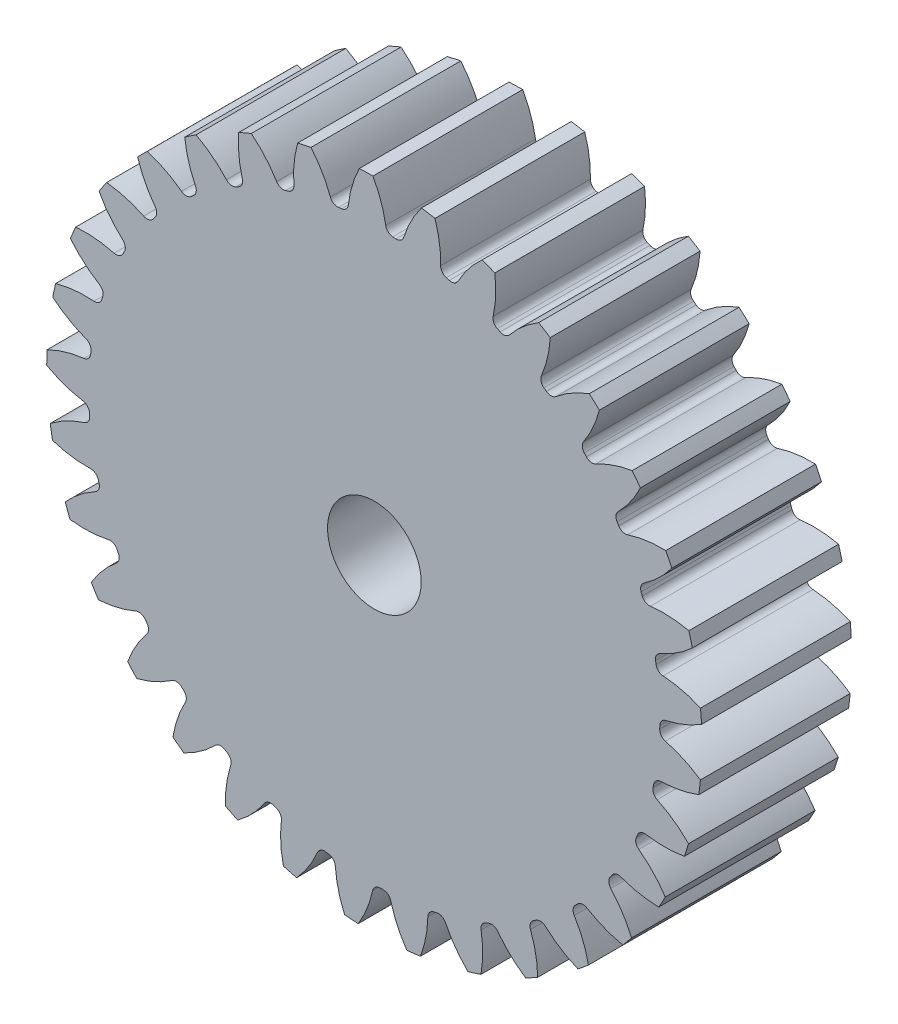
from build123d import *

# Parameters (mm, degrees)
SKETCH3_R         = 222.25
GEARBODY_DEPTH    = 101.6
TOOTHCUT_DEPTH    = 331.322092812
CIRPATTERN1_COUNT = 33
BOREDIA_R         = 31.75
BORE_DEPTH        = 12700


with BuildPart() as part:
    # Sketch3 → gearBody (new body)
    with BuildSketch(Plane.XY):
        Circle(SKETCH3_R)
    extrude(amount=GEARBODY_DEPTH)

    # Sketch2 → toothCut (cut, through all)
    with BuildSketch(Plane.XY):
        with BuildLine():
            ThreePointArc((193.599127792, -5.420640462), (193.626146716, -4.349819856), (193.647242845, -3.278866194))
            ThreePointArc((193.647242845, -3.278866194), (194.822917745, -0.083449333), (197.73095629, 1.687486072))
            ThreePointArc((197.73095629, 1.687486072), (210.434429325, 5.613284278), (222.25, 11.711022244))
            ThreePointArc((222.25, 11.711022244), (222.502191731, -4.99852147), (221.499871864, -21.679882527))
            ThreePointArc((221.499871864, -21.679882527), (209.970054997, -15.057689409), (197.455695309, -10.565371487))
            ThreePointArc((197.455695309, -10.565371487), (194.630118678, -8.665630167), (193.599127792, -5.420640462))
        make_face()
    toothcut = extrude(amount=TOOTHCUT_DEPTH, mode=Mode.SUBTRACT)

    # CirPattern1: toothCut ×33 about axis
    cirpattern1_axis = Axis((0, 0, 0), (0, 0, 1))
    for i in range(1, CIRPATTERN1_COUNT):
        add(toothcut.rotate(cirpattern1_axis, i * 360 / CIRPATTERN1_COUNT), mode=Mode.SUBTRACT)

    # boreDia → bore (cut, symmetric)
    with BuildSketch(Plane.XY):
        Circle(BOREDIA_R)
    extrude(amount=BORE_DEPTH, both=True, mode=Mode.SUBTRACT)


solid = part.part
